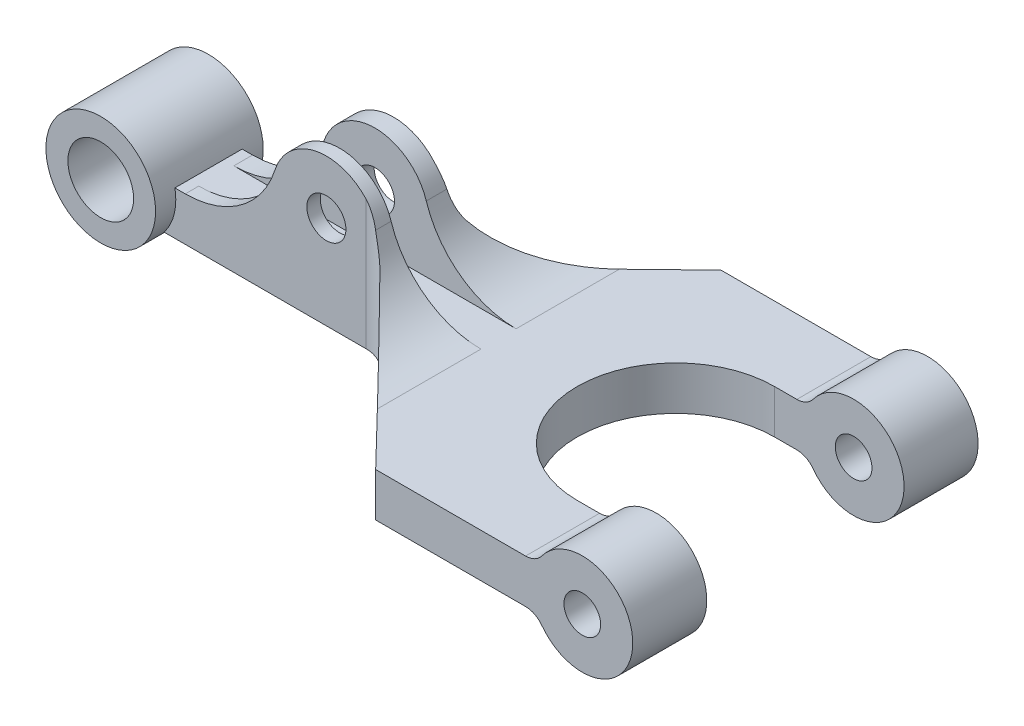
ISO-10303-21;
HEADER;
FILE_DESCRIPTION(('STEP AP214'),'2;1');
FILE_NAME('part.step','',(''),(''),'','','');
FILE_SCHEMA(('AUTOMOTIVE_DESIGN { 1 0 10303 214 1 1 1 1 }'));
ENDSEC;
DATA;
#1=APPLICATION_CONTEXT('core data for automotive mechanical design processes');
#2=APPLICATION_PROTOCOL_DEFINITION('international standard','automotive_design',2000,#1);
#3=PRODUCT_CONTEXT('',#1,'mechanical');
#4=PRODUCT('Part','Part','',(#3));
#5=PRODUCT_RELATED_PRODUCT_CATEGORY('part','',(#4));
#6=PRODUCT_DEFINITION_FORMATION('','',#4);
#7=PRODUCT_DEFINITION_CONTEXT('part definition',#1,'design');
#8=PRODUCT_DEFINITION('design','',#6,#7);
#9=PRODUCT_DEFINITION_SHAPE('','',#8);
#10=(LENGTH_UNIT() NAMED_UNIT(*) SI_UNIT(.MILLI.,.METRE.));
#11=(NAMED_UNIT(*) PLANE_ANGLE_UNIT() SI_UNIT($,.RADIAN.));
#12=(NAMED_UNIT(*) SI_UNIT($,.STERADIAN.) SOLID_ANGLE_UNIT());
#13=UNCERTAINTY_MEASURE_WITH_UNIT(LENGTH_MEASURE(1.E-05),#10,'distance_accuracy_value','');
#14=(GEOMETRIC_REPRESENTATION_CONTEXT(3) GLOBAL_UNCERTAINTY_ASSIGNED_CONTEXT((#13)) GLOBAL_UNIT_ASSIGNED_CONTEXT((#10,
#11,#12)) REPRESENTATION_CONTEXT('',''));
#15=CARTESIAN_POINT('',(0.,0.,0.));
#16=DIRECTION('',(0.,0.,1.));
#17=DIRECTION('',(1.,0.,0.));
#18=AXIS2_PLACEMENT_3D('',#15,#16,#17);
#19=CARTESIAN_POINT('',(12.7411288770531,-63.13435232,-10.));
#20=DIRECTION('',(0.,0.,1.));
#21=DIRECTION('',(1.,0.,0.));
#22=AXIS2_PLACEMENT_3D('',#19,#20,#21);
#23=CYLINDRICAL_SURFACE('',#22,8.);
#24=CARTESIAN_POINT('',(12.7411288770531,-63.13435232,-1.99189092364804));
#25=DIRECTION('',(0.,0.,-1.));
#26=DIRECTION('',(0.,1.,0.));
#27=AXIS2_PLACEMENT_3D('',#24,#25,#26);
#28=CIRCLE('',#27,8.);
#29=CARTESIAN_POINT('',(20.3687027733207,-60.7218605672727,-1.99189092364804));
#30=VERTEX_POINT('',#29);
#31=CARTESIAN_POINT('',(5.11355498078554,-60.7218605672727,-1.99189092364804));
#32=VERTEX_POINT('',#31);
#33=EDGE_CURVE('E243',#30,#32,#28,.F.);
#34=ORIENTED_EDGE('',*,*,#33,.T.);
#35=DIRECTION('',(0.,0.,1.));
#36=VECTOR('',#35,1.);
#37=CARTESIAN_POINT('',(5.11355498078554,-60.7218605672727,-10.));
#38=LINE('',#37,#36);
#39=CARTESIAN_POINT('',(5.11355498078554,-60.7218605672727,0.));
#40=VERTEX_POINT('',#39);
#41=EDGE_CURVE('E324',#32,#40,#38,.T.);
#42=ORIENTED_EDGE('',*,*,#41,.T.);
#43=CARTESIAN_POINT('',(12.7411288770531,-63.13435232,0.));
#44=DIRECTION('',(0.,0.,1.));
#45=DIRECTION('',(1.,0.,0.));
#46=AXIS2_PLACEMENT_3D('',#43,#44,#45);
#47=CIRCLE('',#46,8.);
#48=CARTESIAN_POINT('',(18.6229943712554,-57.7118382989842,0.));
#49=VERTEX_POINT('',#48);
#50=EDGE_CURVE('E305',#49,#40,#47,.T.);
#51=ORIENTED_EDGE('',*,*,#50,.F.);
#52=CARTESIAN_POINT('',(18.6229943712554,-57.7118382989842,0.));
#53=CARTESIAN_POINT('',(18.7685939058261,-57.8697280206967,2.91416028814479E-05));
#54=CARTESIAN_POINT('',(18.9076779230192,-58.0333950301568,0.00635625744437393));
#55=CARTESIAN_POINT('',(19.171906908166,-58.3708607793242,0.0284484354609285));
#56=CARTESIAN_POINT('',(19.2970617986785,-58.5446521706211,0.0442067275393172));
#57=CARTESIAN_POINT('',(19.5306743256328,-58.8980556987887,0.0816816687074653));
#58=CARTESIAN_POINT('',(19.6393857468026,-59.0775128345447,0.103289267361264));
#59=CARTESIAN_POINT('',(19.8422120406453,-59.4440324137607,0.149811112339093));
#60=CARTESIAN_POINT('',(19.9363301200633,-59.6310931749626,0.174724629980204));
#61=CARTESIAN_POINT('',(20.0893222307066,-59.9673745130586,0.219344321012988));
#62=CARTESIAN_POINT('',(20.1512914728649,-60.1152162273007,0.238906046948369));
#63=CARTESIAN_POINT('',(20.26665757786,-60.4154463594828,0.277494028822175));
#64=CARTESIAN_POINT('',(20.319993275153,-60.5678588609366,0.296515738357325));
#65=CARTESIAN_POINT('',(20.3687027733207,-60.7218605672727,0.314650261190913));
#66=B_SPLINE_CURVE_WITH_KNOTS('',3,(#52,#53,#54,#55,#56,#57,#58,#59,#60,#61,#62,#63,#64,#65),
.UNSPECIFIED.,.F.,.F.,(4,2,2,2,2,2,4),(0.,0.643821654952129,1.2871817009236,1.91928757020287,
2.55125434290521,3.0354583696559,3.52295539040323),.UNSPECIFIED.);
#67=CARTESIAN_POINT('',(20.3687027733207,-60.7218605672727,0.314650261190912));
#68=VERTEX_POINT('',#67);
#69=EDGE_CURVE('E395',#49,#68,#66,.T.);
#70=ORIENTED_EDGE('',*,*,#69,.T.);
#71=DIRECTION('',(0.,0.,1.));
#72=VECTOR('',#71,1.);
#73=CARTESIAN_POINT('',(20.3687027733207,-60.7218605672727,-10.));
#74=LINE('',#73,#72);
#75=EDGE_CURVE('E62',#68,#30,#74,.F.);
#76=ORIENTED_EDGE('',*,*,#75,.T.);
#77=EDGE_LOOP('',(#34,#42,#51,#70,#76));
#78=FACE_BOUND('',#77,.T.);
#79=ADVANCED_FACE('F34',(#78),#23,.T.);
#80=DIRECTION('',(0.,0.,1.));
#81=VECTOR('',#80,1.);
#82=CARTESIAN_POINT('',(20.3687027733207,-60.7218605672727,-10.));
#83=LINE('',#82,#81);
#84=CARTESIAN_POINT('',(20.3687027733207,-60.7218605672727,-7.21988533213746));
#85=VERTEX_POINT('',#84);
#86=CARTESIAN_POINT('',(20.3687027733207,-60.7218605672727,-10.2807551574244));
#87=VERTEX_POINT('',#86);
#88=EDGE_CURVE('E54',#85,#87,#83,.F.);
#89=ORIENTED_EDGE('',*,*,#88,.T.);
#90=CARTESIAN_POINT('',(20.3687027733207,-60.7218605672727,-10.2807551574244));
#91=CARTESIAN_POINT('',(20.3046319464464,-60.5192759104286,-10.2583697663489));
#92=CARTESIAN_POINT('',(20.2325312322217,-60.3193959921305,-10.234554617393));
#93=CARTESIAN_POINT('',(20.0726017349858,-59.925823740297,-10.1865890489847));
#94=CARTESIAN_POINT('',(19.9847565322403,-59.7321381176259,-10.1624383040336));
#95=CARTESIAN_POINT('',(19.7955420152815,-59.3556164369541,-10.1168021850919));
#96=CARTESIAN_POINT('',(19.694447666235,-59.1726471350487,-10.095276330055));
#97=CARTESIAN_POINT('',(19.4780588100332,-58.8149289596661,-10.0570681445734));
#98=CARTESIAN_POINT('',(19.3627758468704,-58.6401735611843,-10.0403819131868));
#99=CARTESIAN_POINT('',(19.1595090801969,-58.3569283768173,-10.0189676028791));
#100=CARTESIAN_POINT('',(19.075325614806,-58.2458596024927,-10.0121060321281));
#101=CARTESIAN_POINT('',(18.9006561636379,-58.0275030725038,-10.0026118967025));
#102=CARTESIAN_POINT('',(18.8101350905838,-57.9202422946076,-10.0000051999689));
#103=CARTESIAN_POINT('',(18.7168165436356,-57.8154091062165,-10.));
#104=B_SPLINE_CURVE_WITH_KNOTS('',3,(#90,#91,#92,#93,#94,#95,#96,#97,#98,#99,#100,#101,#102,
#103),.UNSPECIFIED.,.F.,.F.,(4,2,2,2,2,2,4),(0.,0.640779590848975,1.28223137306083,
1.91201914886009,2.54129786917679,2.95966838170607,3.38057307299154),.UNSPECIFIED.);
#105=CARTESIAN_POINT('',(18.7168165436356,-57.8154091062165,-10.));
#106=VERTEX_POINT('',#105);
#107=EDGE_CURVE('E11',#87,#106,#104,.T.);
#108=ORIENTED_EDGE('',*,*,#107,.T.);
#109=CARTESIAN_POINT('',(12.7411288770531,-63.13435232,-10.));
#110=DIRECTION('',(0.,0.,1.));
#111=DIRECTION('',(1.,0.,0.));
#112=AXIS2_PLACEMENT_3D('',#109,#110,#111);
#113=CIRCLE('',#112,8.);
#114=CARTESIAN_POINT('',(5.11355498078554,-60.7218605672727,-10.));
#115=VERTEX_POINT('',#114);
#116=EDGE_CURVE('E308',#106,#115,#113,.T.);
#117=ORIENTED_EDGE('',*,*,#116,.T.);
#118=DIRECTION('',(0.,0.,1.));
#119=VECTOR('',#118,1.);
#120=CARTESIAN_POINT('',(5.11355498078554,-60.7218605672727,-10.));
#121=LINE('',#120,#119);
#122=CARTESIAN_POINT('',(5.11355498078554,-60.7218605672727,-7.21988533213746));
#123=VERTEX_POINT('',#122);
#124=EDGE_CURVE('E328',#115,#123,#121,.T.);
#125=ORIENTED_EDGE('',*,*,#124,.T.);
#126=CARTESIAN_POINT('',(12.7411288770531,-63.13435232,-7.21988533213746));
#127=DIRECTION('',(0.,0.,1.));
#128=DIRECTION('',(0.,-1.,0.));
#129=AXIS2_PLACEMENT_3D('',#126,#127,#128);
#130=CIRCLE('',#129,8.);
#131=EDGE_CURVE('E482',#123,#85,#130,.F.);
#132=ORIENTED_EDGE('',*,*,#131,.T.);
#133=EDGE_LOOP('',(#89,#108,#117,#125,#132));
#134=FACE_BOUND('',#133,.T.);
#135=ADVANCED_FACE('F415',(#134),#23,.T.);
#136=CARTESIAN_POINT('',(12.7411288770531,-63.13435232,-10.));
#137=DIRECTION('',(0.,0.,1.));
#138=DIRECTION('',(1.,0.,0.));
#139=AXIS2_PLACEMENT_3D('',#136,#137,#138);
#140=CYLINDRICAL_SURFACE('',#139,2.9);
#141=CARTESIAN_POINT('',(12.7411288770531,-63.13435232,0.));
#142=DIRECTION('',(0.,0.,1.));
#143=DIRECTION('',(1.,0.,0.));
#144=AXIS2_PLACEMENT_3D('',#141,#142,#143);
#145=CIRCLE('',#144,2.9);
#146=CARTESIAN_POINT('',(15.6411288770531,-63.13435232,0.));
#147=VERTEX_POINT('',#146);
#148=EDGE_CURVE('E301',#147,#147,#145,.T.);
#149=ORIENTED_EDGE('',*,*,#148,.T.);
#150=EDGE_LOOP('',(#149));
#151=FACE_BOUND('',#150,.T.);
#152=CARTESIAN_POINT('',(12.7411288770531,-63.13435232,-1.99189092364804));
#153=DIRECTION('',(0.,0.,-1.));
#154=DIRECTION('',(0.,1.,0.));
#155=AXIS2_PLACEMENT_3D('',#152,#153,#154);
#156=CIRCLE('',#155,2.9);
#157=CARTESIAN_POINT('',(12.7411288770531,-60.23435232,-1.99189092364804));
#158=VERTEX_POINT('',#157);
#159=EDGE_CURVE('E248',#158,#158,#156,.F.);
#160=ORIENTED_EDGE('',*,*,#159,.F.);
#161=EDGE_LOOP('',(#160));
#162=FACE_BOUND('',#161,.T.);
#163=ADVANCED_FACE('F488',(#151,#162),#140,.F.);
#164=CARTESIAN_POINT('',(12.7411288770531,-63.13435232,-10.));
#165=DIRECTION('',(0.,0.,1.));
#166=DIRECTION('',(1.,0.,0.));
#167=AXIS2_PLACEMENT_3D('',#164,#165,#166);
#168=CIRCLE('',#167,2.9);
#169=CARTESIAN_POINT('',(15.6411288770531,-63.13435232,-10.));
#170=VERTEX_POINT('',#169);
#171=EDGE_CURVE('E302',#170,#170,#168,.T.);
#172=ORIENTED_EDGE('',*,*,#171,.F.);
#173=EDGE_LOOP('',(#172));
#174=FACE_BOUND('',#173,.T.);
#175=CARTESIAN_POINT('',(12.7411288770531,-63.13435232,-7.21988533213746));
#176=DIRECTION('',(0.,0.,1.));
#177=DIRECTION('',(0.,-1.,0.));
#178=AXIS2_PLACEMENT_3D('',#175,#176,#177);
#179=CIRCLE('',#178,2.9);
#180=CARTESIAN_POINT('',(12.7411288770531,-66.03435232,-7.21988533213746));
#181=VERTEX_POINT('',#180);
#182=EDGE_CURVE('E479',#181,#181,#179,.F.);
#183=ORIENTED_EDGE('',*,*,#182,.F.);
#184=EDGE_LOOP('',(#183));
#185=FACE_BOUND('',#184,.T.);
#186=ADVANCED_FACE('F490',(#174,#185),#140,.F.);
#187=CARTESIAN_POINT('',(12.7411288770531,-63.13435232,-10.));
#188=DIRECTION('',(0.,0.,1.));
#189=DIRECTION('',(1.,0.,0.));
#190=AXIS2_PLACEMENT_3D('',#187,#188,#189);
#191=PLANE('',#190);
#192=ORIENTED_EDGE('',*,*,#171,.T.);
#193=EDGE_LOOP('',(#192));
#194=FACE_BOUND('',#193,.T.);
#195=ORIENTED_EDGE('',*,*,#116,.F.);
#196=DIRECTION('',(0.,-1.,0.));
#197=VECTOR('',#196,1.);
#198=CARTESIAN_POINT('',(18.7168165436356,-77.,-10.));
#199=LINE('',#198,#197);
#200=CARTESIAN_POINT('',(18.7168165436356,-77.,-10.));
#201=VERTEX_POINT('',#200);
#202=EDGE_CURVE('E389',#106,#201,#199,.T.);
#203=ORIENTED_EDGE('',*,*,#202,.T.);
#204=DIRECTION('',(-1.,0.,0.));
#205=VECTOR('',#204,1.);
#206=CARTESIAN_POINT('',(12.7411288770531,-77.,-10.));
#207=LINE('',#206,#205);
#208=CARTESIAN_POINT('',(-11.3864028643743,-77.,-10.));
#209=VERTEX_POINT('',#208);
#210=EDGE_CURVE('E267',#201,#209,#207,.T.);
#211=ORIENTED_EDGE('',*,*,#210,.T.);
#212=CARTESIAN_POINT('',(-17.7935503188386,-71.9601711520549,-10.));
#213=DIRECTION('',(0.,0.,1.));
#214=DIRECTION('',(1.,0.,0.));
#215=AXIS2_PLACEMENT_3D('',#212,#213,#214);
#216=CIRCLE('',#215,8.15177363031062);
#217=CARTESIAN_POINT('',(-9.7736180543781,-70.5,-10.));
#218=VERTEX_POINT('',#217);
#219=EDGE_CURVE('E220',#209,#218,#216,.T.);
#220=ORIENTED_EDGE('',*,*,#219,.T.);
#221=DIRECTION('',(-1.,0.,0.));
#222=VECTOR('',#221,1.);
#223=CARTESIAN_POINT('',(12.7411288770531,-70.5,-10.));
#224=LINE('',#223,#222);
#225=CARTESIAN_POINT('',(-8.23469933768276,-70.5,-10.));
#226=VERTEX_POINT('',#225);
#227=EDGE_CURVE('E287',#226,#218,#224,.T.);
#228=ORIENTED_EDGE('',*,*,#227,.F.);
#229=CARTESIAN_POINT('',(-8.23469933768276,-56.5,-10.));
#230=DIRECTION('',(0.,0.,1.));
#231=DIRECTION('',(1.,0.,0.));
#232=AXIS2_PLACEMENT_3D('',#229,#230,#231);
#233=CIRCLE('',#232,14.);
#234=EDGE_CURVE('E334',#226,#115,#233,.T.);
#235=ORIENTED_EDGE('',*,*,#234,.T.);
#236=EDGE_LOOP('',(#195,#203,#211,#220,#228,#235));
#237=FACE_BOUND('',#236,.T.);
#238=ADVANCED_FACE('F497',(#194,#237),#191,.F.);
#239=CARTESIAN_POINT('',(12.7411288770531,-63.13435232,0.));
#240=DIRECTION('',(0.,0.,1.));
#241=DIRECTION('',(1.,0.,0.));
#242=AXIS2_PLACEMENT_3D('',#239,#240,#241);
#243=PLANE('',#242);
#244=DIRECTION('',(1.,0.,0.));
#245=VECTOR('',#244,1.);
#246=CARTESIAN_POINT('',(20.7411288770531,-77.,0.));
#247=LINE('',#246,#245);
#248=CARTESIAN_POINT('',(-11.3864028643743,-77.,0.));
#249=VERTEX_POINT('',#248);
#250=CARTESIAN_POINT('',(18.6229943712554,-77.,0.));
#251=VERTEX_POINT('',#250);
#252=EDGE_CURVE('E232',#249,#251,#247,.T.);
#253=ORIENTED_EDGE('',*,*,#252,.T.);
#254=DIRECTION('',(0.,-1.,0.));
#255=VECTOR('',#254,1.);
#256=CARTESIAN_POINT('',(18.6229943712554,-63.13435232,0.));
#257=LINE('',#256,#255);
#258=EDGE_CURVE('E387',#251,#49,#257,.F.);
#259=ORIENTED_EDGE('',*,*,#258,.T.);
#260=ORIENTED_EDGE('',*,*,#50,.T.);
#261=CARTESIAN_POINT('',(-8.23469933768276,-56.5,0.));
#262=DIRECTION('',(0.,0.,1.));
#263=DIRECTION('',(1.,0.,0.));
#264=AXIS2_PLACEMENT_3D('',#261,#262,#263);
#265=CIRCLE('',#264,14.);
#266=CARTESIAN_POINT('',(-8.23469933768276,-70.5,0.));
#267=VERTEX_POINT('',#266);
#268=EDGE_CURVE('E332',#40,#267,#265,.F.);
#269=ORIENTED_EDGE('',*,*,#268,.T.);
#270=DIRECTION('',(1.,0.,0.));
#271=VECTOR('',#270,1.);
#272=CARTESIAN_POINT('',(20.7411288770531,-70.5,0.));
#273=LINE('',#272,#271);
#274=CARTESIAN_POINT('',(-9.7736180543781,-70.5,0.));
#275=VERTEX_POINT('',#274);
#276=EDGE_CURVE('E235',#275,#267,#273,.T.);
#277=ORIENTED_EDGE('',*,*,#276,.F.);
#278=CARTESIAN_POINT('',(-17.7935503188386,-71.9601711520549,0.));
#279=DIRECTION('',(0.,0.,1.));
#280=DIRECTION('',(1.,0.,0.));
#281=AXIS2_PLACEMENT_3D('',#278,#279,#280);
#282=CIRCLE('',#281,8.15177363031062);
#283=EDGE_CURVE('E217',#249,#275,#282,.T.);
#284=ORIENTED_EDGE('',*,*,#283,.F.);
#285=EDGE_LOOP('',(#253,#259,#260,#269,#277,#284));
#286=FACE_BOUND('',#285,.T.);
#287=ORIENTED_EDGE('',*,*,#148,.F.);
#288=EDGE_LOOP('',(#287));
#289=FACE_BOUND('',#288,.T.);
#290=ADVANCED_FACE('F230',(#286,#289),#243,.T.);
#291=CARTESIAN_POINT('',(60.343112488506,-70.5,-4.33827992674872));
#292=DIRECTION('',(0.,1.,0.));
#293=DIRECTION('',(0.,0.,1.));
#294=AXIS2_PLACEMENT_3D('',#291,#292,#293);
#295=PLANE('',#294);
#296=DIRECTION('',(1.,0.,0.));
#297=VECTOR('',#296,1.);
#298=CARTESIAN_POINT('',(41.3922499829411,-70.5,21.3234401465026));
#299=LINE('',#298,#297);
#300=CARTESIAN_POINT('',(41.3922499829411,-70.5,21.3234401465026));
#301=VERTEX_POINT('',#300);
#302=CARTESIAN_POINT('',(63.6650968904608,-70.5,21.3234401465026));
#303=VERTEX_POINT('',#302);
#304=EDGE_CURVE('E272',#301,#303,#299,.T.);
#305=ORIENTED_EDGE('',*,*,#304,.T.);
#306=DIRECTION('',(0.,0.,-1.));
#307=VECTOR('',#306,1.);
#308=CARTESIAN_POINT('',(63.6650968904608,-70.5,10.3234401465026));
#309=LINE('',#308,#307);
#310=CARTESIAN_POINT('',(63.6650968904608,-70.5,10.3234401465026));
#311=VERTEX_POINT('',#310);
#312=EDGE_CURVE('E360',#303,#311,#309,.T.);
#313=ORIENTED_EDGE('',*,*,#312,.T.);
#314=DIRECTION('',(-1.,0.,0.));
#315=VECTOR('',#314,1.);
#316=CARTESIAN_POINT('',(60.343112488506,-70.5,10.3234401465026));
#317=LINE('',#316,#315);
#318=CARTESIAN_POINT('',(60.343112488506,-70.5,10.3234401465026));
#319=VERTEX_POINT('',#318);
#320=EDGE_CURVE('E275',#311,#319,#317,.T.);
#321=ORIENTED_EDGE('',*,*,#320,.T.);
#322=CARTESIAN_POINT('',(60.343112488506,-70.5,-4.33827992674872));
#323=DIRECTION('',(0.,-1.,0.));
#324=DIRECTION('',(0.,0.,1.));
#325=AXIS2_PLACEMENT_3D('',#322,#323,#324);
#326=CIRCLE('',#325,14.6617200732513);
#327=CARTESIAN_POINT('',(60.343112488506,-70.5,-19.));
#328=VERTEX_POINT('',#327);
#329=EDGE_CURVE('E277',#319,#328,#326,.T.);
#330=ORIENTED_EDGE('',*,*,#329,.T.);
#331=DIRECTION('',(1.,0.,0.));
#332=VECTOR('',#331,1.);
#333=CARTESIAN_POINT('',(65.343112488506,-70.5,-19.));
#334=LINE('',#333,#332);
#335=CARTESIAN_POINT('',(63.6650968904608,-70.5,-19.));
#336=VERTEX_POINT('',#335);
#337=EDGE_CURVE('E279',#328,#336,#334,.T.);
#338=ORIENTED_EDGE('',*,*,#337,.T.);
#339=DIRECTION('',(0.,0.,-1.));
#340=VECTOR('',#339,1.);
#341=CARTESIAN_POINT('',(63.6650968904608,-70.5,-4.33827992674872));
#342=LINE('',#341,#340);
#343=CARTESIAN_POINT('',(63.6650968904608,-70.5,-30.));
#344=VERTEX_POINT('',#343);
#345=EDGE_CURVE('E357',#336,#344,#342,.T.);
#346=ORIENTED_EDGE('',*,*,#345,.T.);
#347=DIRECTION('',(-1.,0.,0.));
#348=VECTOR('',#347,1.);
#349=CARTESIAN_POINT('',(41.3922499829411,-70.5,-30.));
#350=LINE('',#349,#348);
#351=CARTESIAN_POINT('',(41.3922499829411,-70.5,-30.));
#352=VERTEX_POINT('',#351);
#353=EDGE_CURVE('E282',#344,#352,#350,.T.);
#354=ORIENTED_EDGE('',*,*,#353,.T.);
#355=DIRECTION('',(-0.718340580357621,0.,0.695691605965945));
#356=VECTOR('',#355,1.);
#357=CARTESIAN_POINT('',(20.7411288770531,-70.5,-10.));
#358=LINE('',#357,#356);
#359=CARTESIAN_POINT('',(33.716957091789,-70.5,-22.5667058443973));
#360=VERTEX_POINT('',#359);
#361=EDGE_CURVE('E284',#352,#360,#358,.T.);
#362=ORIENTED_EDGE('',*,*,#361,.T.);
#363=DIRECTION('',(0.,0.,-1.));
#364=VECTOR('',#363,1.);
#365=CARTESIAN_POINT('',(33.716957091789,-70.5,-7.21988533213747));
#366=LINE('',#365,#364);
#367=CARTESIAN_POINT('',(33.716957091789,-70.5,-7.21988533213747));
#368=VERTEX_POINT('',#367);
#369=EDGE_CURVE('E314',#360,#368,#366,.F.);
#370=ORIENTED_EDGE('',*,*,#369,.T.);
#371=DIRECTION('',(-1.,0.,0.));
#372=VECTOR('',#371,1.);
#373=CARTESIAN_POINT('',(65.343112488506,-70.5,-7.21988533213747));
#374=LINE('',#373,#372);
#375=CARTESIAN_POINT('',(-8.23469933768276,-70.5,-7.21988533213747));
#376=VERTEX_POINT('',#375);
#377=EDGE_CURVE('E474',#368,#376,#374,.T.);
#378=ORIENTED_EDGE('',*,*,#377,.T.);
#379=DIRECTION('',(0.,0.,-1.));
#380=VECTOR('',#379,1.);
#381=CARTESIAN_POINT('',(-8.23469933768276,-70.5,-10.));
#382=LINE('',#381,#380);
#383=EDGE_CURVE('E317',#376,#226,#382,.T.);
#384=ORIENTED_EDGE('',*,*,#383,.T.);
#385=ORIENTED_EDGE('',*,*,#227,.T.);
#386=DIRECTION('',(0.,0.,1.));
#387=VECTOR('',#386,1.);
#388=CARTESIAN_POINT('',(-9.7736180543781,-70.5,-13.));
#389=LINE('',#388,#387);
#390=EDGE_CURVE('E459',#275,#218,#389,.F.);
#391=ORIENTED_EDGE('',*,*,#390,.F.);
#392=ORIENTED_EDGE('',*,*,#276,.T.);
#393=DIRECTION('',(0.,0.,-1.));
#394=VECTOR('',#393,1.);
#395=CARTESIAN_POINT('',(-8.23469933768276,-70.5,-1.99189092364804));
#396=LINE('',#395,#394);
#397=CARTESIAN_POINT('',(-8.23469933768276,-70.5,-1.99189092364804));
#398=VERTEX_POINT('',#397);
#399=EDGE_CURVE('E320',#267,#398,#396,.T.);
#400=ORIENTED_EDGE('',*,*,#399,.T.);
#401=DIRECTION('',(-1.,0.,0.));
#402=VECTOR('',#401,1.);
#403=CARTESIAN_POINT('',(65.343112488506,-70.5,-1.99189092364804));
#404=LINE('',#403,#402);
#405=CARTESIAN_POINT('',(33.716957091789,-70.5,-1.99189092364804));
#406=VERTEX_POINT('',#405);
#407=EDGE_CURVE('E458',#406,#398,#404,.T.);
#408=ORIENTED_EDGE('',*,*,#407,.F.);
#409=DIRECTION('',(0.,0.,-1.));
#410=VECTOR('',#409,1.);
#411=CARTESIAN_POINT('',(33.716957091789,-70.5,0.));
#412=LINE('',#411,#410);
#413=CARTESIAN_POINT('',(33.716957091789,-70.5,13.3982699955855));
#414=VERTEX_POINT('',#413);
#415=EDGE_CURVE('E310',#406,#414,#412,.F.);
#416=ORIENTED_EDGE('',*,*,#415,.T.);
#417=DIRECTION('',(0.695691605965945,0.,0.718340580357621));
#418=VECTOR('',#417,1.);
#419=CARTESIAN_POINT('',(20.7411288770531,-70.5,0.));
#420=LINE('',#419,#418);
#421=EDGE_CURVE('E270',#414,#301,#420,.T.);
#422=ORIENTED_EDGE('',*,*,#421,.T.);
#423=EDGE_LOOP('',(#305,#313,#321,#330,#338,#346,#354,#362,#370,#378,#384,#385,#391,#392,#400,
#408,#416,#422));
#424=FACE_BOUND('',#423,.T.);
#425=ADVANCED_FACE('F457',(#424),#295,.T.);
#426=CARTESIAN_POINT('',(20.7411288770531,-70.5,0.));
#427=DIRECTION('',(0.718340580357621,0.,-0.695691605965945));
#428=DIRECTION('',(-0.695691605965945,0.,-0.718340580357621));
#429=AXIS2_PLACEMENT_3D('',#426,#427,#428);
#430=PLANE('',#429);
#431=CARTESIAN_POINT('',(33.716957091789,-56.5,13.3982699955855));
#432=DIRECTION('',(0.718340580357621,0.,-0.695691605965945));
#433=DIRECTION('',(0.695691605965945,0.,0.718340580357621));
#434=AXIS2_PLACEMENT_3D('',#431,#432,#433);
#435=ELLIPSE('',#434,20.1238593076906,14.);
#436=CARTESIAN_POINT('',(22.2146972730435,-64.481103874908,1.52154197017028));
#437=VERTEX_POINT('',#436);
#438=EDGE_CURVE('E344',#414,#437,#435,.T.);
#439=ORIENTED_EDGE('',*,*,#438,.T.);
#440=DIRECTION('',(0.,-1.,0.));
#441=VECTOR('',#440,1.);
#442=CARTESIAN_POINT('',(22.2146972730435,-70.5,1.52154197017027));
#443=LINE('',#442,#441);
#444=CARTESIAN_POINT('',(22.2146972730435,-77.,1.52154197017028));
#445=VERTEX_POINT('',#444);
#446=EDGE_CURVE('E384',#437,#445,#443,.T.);
#447=ORIENTED_EDGE('',*,*,#446,.T.);
#448=DIRECTION('',(0.695691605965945,0.,0.718340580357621));
#449=VECTOR('',#448,1.);
#450=CARTESIAN_POINT('',(20.7411288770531,-77.,0.));
#451=LINE('',#450,#449);
#452=CARTESIAN_POINT('',(41.3922499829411,-77.,21.3234401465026));
#453=VERTEX_POINT('',#452);
#454=EDGE_CURVE('E242',#445,#453,#451,.T.);
#455=ORIENTED_EDGE('',*,*,#454,.T.);
#456=DIRECTION('',(0.,-1.,0.));
#457=VECTOR('',#456,1.);
#458=CARTESIAN_POINT('',(41.3922499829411,-70.5,21.3234401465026));
#459=LINE('',#458,#457);
#460=EDGE_CURVE('E298',#301,#453,#459,.T.);
#461=ORIENTED_EDGE('',*,*,#460,.F.);
#462=ORIENTED_EDGE('',*,*,#421,.F.);
#463=EDGE_LOOP('',(#439,#447,#455,#461,#462));
#464=FACE_BOUND('',#463,.T.);
#465=ADVANCED_FACE('F448',(#464),#430,.F.);
#466=CARTESIAN_POINT('',(41.3922499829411,-70.5,21.3234401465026));
#467=DIRECTION('',(0.,0.,-1.));
#468=DIRECTION('',(-1.,0.,0.));
#469=AXIS2_PLACEMENT_3D('',#466,#467,#468);
#470=PLANE('',#469);
#471=DIRECTION('',(1.,0.,0.));
#472=VECTOR('',#471,1.);
#473=CARTESIAN_POINT('',(41.3922499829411,-77.,21.3234401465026));
#474=LINE('',#473,#472);
#475=CARTESIAN_POINT('',(63.6650968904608,-77.,21.3234401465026));
#476=VERTEX_POINT('',#475);
#477=EDGE_CURVE('E245',#453,#476,#474,.T.);
#478=ORIENTED_EDGE('',*,*,#477,.T.);
#479=CARTESIAN_POINT('',(63.6650968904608,-80.,21.3234401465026));
#480=DIRECTION('',(0.,0.,-1.));
#481=DIRECTION('',(-1.,0.,0.));
#482=AXIS2_PLACEMENT_3D('',#479,#480,#481);
#483=CIRCLE('',#482,3.);
#484=CARTESIAN_POINT('',(66.0757450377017,-78.2142857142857,21.3234401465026));
#485=VERTEX_POINT('',#484);
#486=EDGE_CURVE('E370',#476,#485,#483,.T.);
#487=ORIENTED_EDGE('',*,*,#486,.T.);
#488=CARTESIAN_POINT('',(72.1023654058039,-73.75,21.3234401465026));
#489=DIRECTION('',(0.,0.,1.));
#490=DIRECTION('',(1.,0.,0.));
#491=AXIS2_PLACEMENT_3D('',#488,#489,#490);
#492=CIRCLE('',#491,7.50000000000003);
#493=CARTESIAN_POINT('',(66.0757450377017,-69.2857142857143,21.3234401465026));
#494=VERTEX_POINT('',#493);
#495=EDGE_CURVE('E469',#485,#494,#492,.T.);
#496=ORIENTED_EDGE('',*,*,#495,.T.);
#497=CARTESIAN_POINT('',(63.6650968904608,-67.5,21.3234401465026));
#498=DIRECTION('',(0.,0.,-1.));
#499=DIRECTION('',(-1.,0.,0.));
#500=AXIS2_PLACEMENT_3D('',#497,#498,#499);
#501=CIRCLE('',#500,3.);
#502=EDGE_CURVE('E374',#494,#303,#501,.T.);
#503=ORIENTED_EDGE('',*,*,#502,.T.);
#504=ORIENTED_EDGE('',*,*,#304,.F.);
#505=ORIENTED_EDGE('',*,*,#460,.T.);
#506=EDGE_LOOP('',(#478,#487,#496,#503,#504,#505));
#507=FACE_BOUND('',#506,.T.);
#508=CARTESIAN_POINT('',(72.1023654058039,-73.75,21.3234401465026));
#509=DIRECTION('',(0.,0.,1.));
#510=DIRECTION('',(1.,0.,0.));
#511=AXIS2_PLACEMENT_3D('',#508,#509,#510);
#512=CIRCLE('',#511,2.72660472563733);
#513=CARTESIAN_POINT('',(74.8289701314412,-73.75,21.3234401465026));
#514=VERTEX_POINT('',#513);
#515=EDGE_CURVE('E461',#514,#514,#512,.T.);
#516=ORIENTED_EDGE('',*,*,#515,.F.);
#517=EDGE_LOOP('',(#516));
#518=FACE_BOUND('',#517,.T.);
#519=ADVANCED_FACE('F610',(#507,#518),#470,.F.);
#520=CARTESIAN_POINT('',(60.343112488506,-70.5,10.3234401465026));
#521=DIRECTION('',(0.,0.,1.));
#522=DIRECTION('',(1.,0.,0.));
#523=AXIS2_PLACEMENT_3D('',#520,#521,#522);
#524=PLANE('',#523);
#525=ORIENTED_EDGE('',*,*,#320,.F.);
#526=CARTESIAN_POINT('',(63.6650968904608,-67.5,10.3234401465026));
#527=DIRECTION('',(0.,0.,1.));
#528=DIRECTION('',(1.,0.,0.));
#529=AXIS2_PLACEMENT_3D('',#526,#527,#528);
#530=CIRCLE('',#529,3.);
#531=CARTESIAN_POINT('',(66.0757450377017,-69.2857142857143,10.3234401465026));
#532=VERTEX_POINT('',#531);
#533=EDGE_CURVE('E372',#311,#532,#530,.T.);
#534=ORIENTED_EDGE('',*,*,#533,.T.);
#535=CARTESIAN_POINT('',(72.1023654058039,-73.75,10.3234401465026));
#536=DIRECTION('',(0.,0.,1.));
#537=DIRECTION('',(1.,0.,0.));
#538=AXIS2_PLACEMENT_3D('',#535,#536,#537);
#539=CIRCLE('',#538,7.50000000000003);
#540=CARTESIAN_POINT('',(66.0757450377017,-78.2142857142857,10.3234401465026));
#541=VERTEX_POINT('',#540);
#542=EDGE_CURVE('E471',#541,#532,#539,.T.);
#543=ORIENTED_EDGE('',*,*,#542,.F.);
#544=CARTESIAN_POINT('',(63.6650968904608,-80.,10.3234401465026));
#545=DIRECTION('',(0.,0.,1.));
#546=DIRECTION('',(1.,0.,0.));
#547=AXIS2_PLACEMENT_3D('',#544,#545,#546);
#548=CIRCLE('',#547,3.);
#549=CARTESIAN_POINT('',(63.6650968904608,-77.,10.3234401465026));
#550=VERTEX_POINT('',#549);
#551=EDGE_CURVE('E368',#541,#550,#548,.T.);
#552=ORIENTED_EDGE('',*,*,#551,.T.);
#553=DIRECTION('',(-1.,0.,0.));
#554=VECTOR('',#553,1.);
#555=CARTESIAN_POINT('',(60.343112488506,-77.,10.3234401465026));
#556=LINE('',#555,#554);
#557=CARTESIAN_POINT('',(60.343112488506,-77.,10.3234401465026));
#558=VERTEX_POINT('',#557);
#559=EDGE_CURVE('E254',#550,#558,#556,.T.);
#560=ORIENTED_EDGE('',*,*,#559,.T.);
#561=DIRECTION('',(0.,-1.,0.));
#562=VECTOR('',#561,1.);
#563=CARTESIAN_POINT('',(60.343112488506,-70.5,10.3234401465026));
#564=LINE('',#563,#562);
#565=EDGE_CURVE('E295',#319,#558,#564,.T.);
#566=ORIENTED_EDGE('',*,*,#565,.F.);
#567=EDGE_LOOP('',(#525,#534,#543,#552,#560,#566));
#568=FACE_BOUND('',#567,.T.);
#569=CARTESIAN_POINT('',(72.1023654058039,-73.75,10.3234401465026));
#570=DIRECTION('',(0.,0.,1.));
#571=DIRECTION('',(1.,0.,0.));
#572=AXIS2_PLACEMENT_3D('',#569,#570,#571);
#573=CIRCLE('',#572,2.72660472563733);
#574=CARTESIAN_POINT('',(74.8289701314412,-73.75,10.3234401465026));
#575=VERTEX_POINT('',#574);
#576=EDGE_CURVE('E464',#575,#575,#573,.T.);
#577=ORIENTED_EDGE('',*,*,#576,.T.);
#578=EDGE_LOOP('',(#577));
#579=FACE_BOUND('',#578,.T.);
#580=ADVANCED_FACE('F607',(#568,#579),#524,.F.);
#581=CARTESIAN_POINT('',(60.343112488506,-70.5,-4.33827992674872));
#582=DIRECTION('',(0.,-1.,0.));
#583=DIRECTION('',(0.,0.,-1.));
#584=AXIS2_PLACEMENT_3D('',#581,#582,#583);
#585=CYLINDRICAL_SURFACE('',#584,14.6617200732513);
#586=ORIENTED_EDGE('',*,*,#565,.T.);
#587=CARTESIAN_POINT('',(60.343112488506,-77.,-4.33827992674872));
#588=DIRECTION('',(0.,-1.,0.));
#589=DIRECTION('',(0.,0.,1.));
#590=AXIS2_PLACEMENT_3D('',#587,#588,#589);
#591=CIRCLE('',#590,14.6617200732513);
#592=CARTESIAN_POINT('',(60.343112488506,-77.,-19.));
#593=VERTEX_POINT('',#592);
#594=EDGE_CURVE('E256',#558,#593,#591,.T.);
#595=ORIENTED_EDGE('',*,*,#594,.T.);
#596=DIRECTION('',(0.,-1.,0.));
#597=VECTOR('',#596,1.);
#598=CARTESIAN_POINT('',(60.343112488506,-70.5,-19.));
#599=LINE('',#598,#597);
#600=EDGE_CURVE('E293',#328,#593,#599,.T.);
#601=ORIENTED_EDGE('',*,*,#600,.F.);
#602=ORIENTED_EDGE('',*,*,#329,.F.);
#603=EDGE_LOOP('',(#586,#595,#601,#602));
#604=FACE_BOUND('',#603,.T.);
#605=ADVANCED_FACE('F604',(#604),#585,.F.);
#606=CARTESIAN_POINT('',(65.343112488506,-70.5,-19.));
#607=DIRECTION('',(0.,0.,-1.));
#608=DIRECTION('',(-1.,0.,0.));
#609=AXIS2_PLACEMENT_3D('',#606,#607,#608);
#610=PLANE('',#609);
#611=DIRECTION('',(1.,0.,0.));
#612=VECTOR('',#611,1.);
#613=CARTESIAN_POINT('',(65.343112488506,-77.,-19.));
#614=LINE('',#613,#612);
#615=CARTESIAN_POINT('',(63.6650968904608,-77.,-19.));
#616=VERTEX_POINT('',#615);
#617=EDGE_CURVE('E259',#593,#616,#614,.T.);
#618=ORIENTED_EDGE('',*,*,#617,.T.);
#619=CARTESIAN_POINT('',(63.6650968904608,-80.,-19.));
#620=DIRECTION('',(0.,0.,-1.));
#621=DIRECTION('',(-1.,0.,0.));
#622=AXIS2_PLACEMENT_3D('',#619,#620,#621);
#623=CIRCLE('',#622,3.);
#624=CARTESIAN_POINT('',(66.0757450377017,-78.2142857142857,-19.));
#625=VERTEX_POINT('',#624);
#626=EDGE_CURVE('E378',#616,#625,#623,.T.);
#627=ORIENTED_EDGE('',*,*,#626,.T.);
#628=CARTESIAN_POINT('',(72.1023654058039,-73.75,-19.));
#629=DIRECTION('',(0.,0.,1.));
#630=DIRECTION('',(1.,0.,0.));
#631=AXIS2_PLACEMENT_3D('',#628,#629,#630);
#632=CIRCLE('',#631,7.5);
#633=CARTESIAN_POINT('',(66.0757450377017,-69.2857142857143,-19.));
#634=VERTEX_POINT('',#633);
#635=EDGE_CURVE('E536',#625,#634,#632,.T.);
#636=ORIENTED_EDGE('',*,*,#635,.T.);
#637=CARTESIAN_POINT('',(63.6650968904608,-67.5,-19.));
#638=DIRECTION('',(0.,0.,-1.));
#639=DIRECTION('',(-1.,0.,0.));
#640=AXIS2_PLACEMENT_3D('',#637,#638,#639);
#641=CIRCLE('',#640,3.);
#642=EDGE_CURVE('E382',#634,#336,#641,.T.);
#643=ORIENTED_EDGE('',*,*,#642,.T.);
#644=ORIENTED_EDGE('',*,*,#337,.F.);
#645=ORIENTED_EDGE('',*,*,#600,.T.);
#646=EDGE_LOOP('',(#618,#627,#636,#643,#644,#645));
#647=FACE_BOUND('',#646,.T.);
#648=CARTESIAN_POINT('',(72.1023654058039,-73.75,-19.));
#649=DIRECTION('',(0.,0.,1.));
#650=DIRECTION('',(1.,0.,0.));
#651=AXIS2_PLACEMENT_3D('',#648,#649,#650);
#652=CIRCLE('',#651,2.72500000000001);
#653=CARTESIAN_POINT('',(74.8273654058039,-73.75,-19.));
#654=VERTEX_POINT('',#653);
#655=EDGE_CURVE('E549',#654,#654,#652,.T.);
#656=ORIENTED_EDGE('',*,*,#655,.F.);
#657=EDGE_LOOP('',(#656));
#658=FACE_BOUND('',#657,.T.);
#659=ADVANCED_FACE('F534',(#647,#658),#610,.F.);
#660=CARTESIAN_POINT('',(41.3922499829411,-70.5,-30.));
#661=DIRECTION('',(0.,0.,1.));
#662=DIRECTION('',(1.,0.,0.));
#663=AXIS2_PLACEMENT_3D('',#660,#661,#662);
#664=PLANE('',#663);
#665=ORIENTED_EDGE('',*,*,#353,.F.);
#666=CARTESIAN_POINT('',(63.6650968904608,-67.5,-30.));
#667=DIRECTION('',(0.,0.,1.));
#668=DIRECTION('',(1.,0.,0.));
#669=AXIS2_PLACEMENT_3D('',#666,#667,#668);
#670=CIRCLE('',#669,3.);
#671=CARTESIAN_POINT('',(66.0757450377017,-69.2857142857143,-30.));
#672=VERTEX_POINT('',#671);
#673=EDGE_CURVE('E380',#344,#672,#670,.T.);
#674=ORIENTED_EDGE('',*,*,#673,.T.);
#675=CARTESIAN_POINT('',(72.1023654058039,-73.75,-30.));
#676=DIRECTION('',(0.,0.,1.));
#677=DIRECTION('',(1.,0.,0.));
#678=AXIS2_PLACEMENT_3D('',#675,#676,#677);
#679=CIRCLE('',#678,7.5);
#680=CARTESIAN_POINT('',(66.0757450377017,-78.2142857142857,-30.));
#681=VERTEX_POINT('',#680);
#682=EDGE_CURVE('E544',#681,#672,#679,.T.);
#683=ORIENTED_EDGE('',*,*,#682,.F.);
#684=CARTESIAN_POINT('',(63.6650968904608,-80.,-30.));
#685=DIRECTION('',(0.,0.,1.));
#686=DIRECTION('',(1.,0.,0.));
#687=AXIS2_PLACEMENT_3D('',#684,#685,#686);
#688=CIRCLE('',#687,3.);
#689=CARTESIAN_POINT('',(63.6650968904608,-77.,-30.));
#690=VERTEX_POINT('',#689);
#691=EDGE_CURVE('E376',#681,#690,#688,.T.);
#692=ORIENTED_EDGE('',*,*,#691,.T.);
#693=DIRECTION('',(-1.,0.,0.));
#694=VECTOR('',#693,1.);
#695=CARTESIAN_POINT('',(41.3922499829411,-77.,-30.));
#696=LINE('',#695,#694);
#697=CARTESIAN_POINT('',(41.3922499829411,-77.,-30.));
#698=VERTEX_POINT('',#697);
#699=EDGE_CURVE('E262',#690,#698,#696,.T.);
#700=ORIENTED_EDGE('',*,*,#699,.T.);
#701=DIRECTION('',(0.,-1.,0.));
#702=VECTOR('',#701,1.);
#703=CARTESIAN_POINT('',(41.3922499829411,-70.5,-30.));
#704=LINE('',#703,#702);
#705=EDGE_CURVE('E290',#352,#698,#704,.T.);
#706=ORIENTED_EDGE('',*,*,#705,.F.);
#707=EDGE_LOOP('',(#665,#674,#683,#692,#700,#706));
#708=FACE_BOUND('',#707,.T.);
#709=CARTESIAN_POINT('',(72.1023654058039,-73.75,-30.));
#710=DIRECTION('',(0.,0.,1.));
#711=DIRECTION('',(1.,0.,0.));
#712=AXIS2_PLACEMENT_3D('',#709,#710,#711);
#713=CIRCLE('',#712,2.72500000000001);
#714=CARTESIAN_POINT('',(74.8273654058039,-73.75,-30.));
#715=VERTEX_POINT('',#714);
#716=EDGE_CURVE('E552',#715,#715,#713,.T.);
#717=ORIENTED_EDGE('',*,*,#716,.T.);
#718=EDGE_LOOP('',(#717));
#719=FACE_BOUND('',#718,.T.);
#720=ADVANCED_FACE('F599',(#708,#719),#664,.F.);
#721=CARTESIAN_POINT('',(20.7411288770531,-70.5,-10.));
#722=DIRECTION('',(0.695691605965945,0.,0.718340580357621));
#723=DIRECTION('',(0.718340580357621,0.,-0.695691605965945));
#724=AXIS2_PLACEMENT_3D('',#721,#722,#723);
#725=PLANE('',#724);
#726=DIRECTION('',(-0.718340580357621,0.,0.695691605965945));
#727=VECTOR('',#726,1.);
#728=CARTESIAN_POINT('',(20.7411288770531,-77.,-10.));
#729=LINE('',#728,#727);
#730=CARTESIAN_POINT('',(22.1952745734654,-77.,-11.4082970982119));
#731=VERTEX_POINT('',#730);
#732=EDGE_CURVE('E264',#698,#731,#729,.T.);
#733=ORIENTED_EDGE('',*,*,#732,.T.);
#734=DIRECTION('',(0.,-1.,0.));
#735=VECTOR('',#734,1.);
#736=CARTESIAN_POINT('',(22.1952745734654,-61.7562231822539,-11.4082970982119));
#737=LINE('',#736,#735);
#738=CARTESIAN_POINT('',(22.1952745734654,-64.4530391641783,-11.4082970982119));
#739=VERTEX_POINT('',#738);
#740=EDGE_CURVE('E392',#731,#739,#737,.F.);
#741=ORIENTED_EDGE('',*,*,#740,.T.);
#742=CARTESIAN_POINT('',(33.716957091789,-56.5,-22.5667058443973));
#743=DIRECTION('',(0.695691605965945,0.,0.718340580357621));
#744=DIRECTION('',(-0.718340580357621,0.,0.695691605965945));
#745=AXIS2_PLACEMENT_3D('',#742,#743,#744);
#746=ELLIPSE('',#745,19.4893625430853,14.);
#747=EDGE_CURVE('E342',#739,#360,#746,.T.);
#748=ORIENTED_EDGE('',*,*,#747,.T.);
#749=ORIENTED_EDGE('',*,*,#361,.F.);
#750=ORIENTED_EDGE('',*,*,#705,.T.);
#751=EDGE_LOOP('',(#733,#741,#748,#749,#750));
#752=FACE_BOUND('',#751,.T.);
#753=ADVANCED_FACE('F517',(#752),#725,.F.);
#754=CARTESIAN_POINT('',(60.343112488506,-77.,-4.33827992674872));
#755=DIRECTION('',(0.,1.,0.));
#756=DIRECTION('',(0.,0.,1.));
#757=AXIS2_PLACEMENT_3D('',#754,#755,#756);
#758=PLANE('',#757);
#759=ORIENTED_EDGE('',*,*,#559,.F.);
#760=DIRECTION('',(0.,0.,1.));
#761=VECTOR('',#760,1.);
#762=CARTESIAN_POINT('',(63.6650968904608,-77.,-4.33827992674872));
#763=LINE('',#762,#761);
#764=EDGE_CURVE('E355',#550,#476,#763,.T.);
#765=ORIENTED_EDGE('',*,*,#764,.T.);
#766=ORIENTED_EDGE('',*,*,#477,.F.);
#767=ORIENTED_EDGE('',*,*,#454,.F.);
#768=CARTESIAN_POINT('',(18.6229943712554,-77.,5.));
#769=DIRECTION('',(0.,1.,0.));
#770=DIRECTION('',(0.,0.,1.));
#771=AXIS2_PLACEMENT_3D('',#768,#769,#770);
#772=CIRCLE('',#771,5.);
#773=EDGE_CURVE('E241',#445,#251,#772,.T.);
#774=ORIENTED_EDGE('',*,*,#773,.T.);
#775=ORIENTED_EDGE('',*,*,#252,.F.);
#776=DIRECTION('',(0.,0.,1.));
#777=VECTOR('',#776,1.);
#778=CARTESIAN_POINT('',(-11.3864028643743,-77.,-13.));
#779=LINE('',#778,#777);
#780=EDGE_CURVE('E213',#249,#209,#779,.F.);
#781=ORIENTED_EDGE('',*,*,#780,.T.);
#782=ORIENTED_EDGE('',*,*,#210,.F.);
#783=CARTESIAN_POINT('',(18.7168165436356,-77.,-15.));
#784=DIRECTION('',(0.,1.,0.));
#785=DIRECTION('',(0.,0.,1.));
#786=AXIS2_PLACEMENT_3D('',#783,#784,#785);
#787=CIRCLE('',#786,5.);
#788=EDGE_CURVE('E439',#201,#731,#787,.T.);
#789=ORIENTED_EDGE('',*,*,#788,.T.);
#790=ORIENTED_EDGE('',*,*,#732,.F.);
#791=ORIENTED_EDGE('',*,*,#699,.F.);
#792=DIRECTION('',(0.,0.,1.));
#793=VECTOR('',#792,1.);
#794=CARTESIAN_POINT('',(63.6650968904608,-77.,-19.));
#795=LINE('',#794,#793);
#796=EDGE_CURVE('E353',#690,#616,#795,.T.);
#797=ORIENTED_EDGE('',*,*,#796,.T.);
#798=ORIENTED_EDGE('',*,*,#617,.F.);
#799=ORIENTED_EDGE('',*,*,#594,.F.);
#800=EDGE_LOOP('',(#759,#765,#766,#767,#774,#775,#781,#782,#789,#790,#791,#797,#798,#799));
#801=FACE_BOUND('',#800,.T.);
#802=ADVANCED_FACE('F239',(#801),#758,.F.);
#803=CARTESIAN_POINT('',(65.343112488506,-52.3482254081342,-1.99189092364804));
#804=DIRECTION('',(0.,0.,-1.));
#805=DIRECTION('',(0.,1.,0.));
#806=AXIS2_PLACEMENT_3D('',#803,#804,#805);
#807=PLANE('',#806);
#808=ORIENTED_EDGE('',*,*,#407,.T.);
#809=CARTESIAN_POINT('',(-8.23469933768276,-56.5,-1.99189092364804));
#810=DIRECTION('',(0.,0.,-1.));
#811=DIRECTION('',(0.,1.,0.));
#812=AXIS2_PLACEMENT_3D('',#809,#810,#811);
#813=CIRCLE('',#812,14.);
#814=EDGE_CURVE('E330',#398,#32,#813,.F.);
#815=ORIENTED_EDGE('',*,*,#814,.T.);
#816=ORIENTED_EDGE('',*,*,#33,.F.);
#817=CARTESIAN_POINT('',(33.716957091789,-56.5,-1.99189092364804));
#818=DIRECTION('',(0.,0.,-1.));
#819=DIRECTION('',(0.,1.,0.));
#820=AXIS2_PLACEMENT_3D('',#817,#818,#819);
#821=CIRCLE('',#820,14.);
#822=EDGE_CURVE('E225',#30,#406,#821,.F.);
#823=ORIENTED_EDGE('',*,*,#822,.T.);
#824=EDGE_LOOP('',(#808,#815,#816,#823));
#825=FACE_BOUND('',#824,.T.);
#826=ORIENTED_EDGE('',*,*,#159,.T.);
#827=EDGE_LOOP('',(#826));
#828=FACE_BOUND('',#827,.T.);
#829=ADVANCED_FACE('F486',(#825,#828),#807,.T.);
#830=CARTESIAN_POINT('',(65.343112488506,-52.3482254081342,-7.21988533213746));
#831=DIRECTION('',(0.,0.,1.));
#832=DIRECTION('',(0.,-1.,0.));
#833=AXIS2_PLACEMENT_3D('',#830,#831,#832);
#834=PLANE('',#833);
#835=ORIENTED_EDGE('',*,*,#377,.F.);
#836=CARTESIAN_POINT('',(33.716957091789,-56.5,-7.21988533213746));
#837=DIRECTION('',(0.,0.,1.));
#838=DIRECTION('',(0.,-1.,0.));
#839=AXIS2_PLACEMENT_3D('',#836,#837,#838);
#840=CIRCLE('',#839,14.);
#841=EDGE_CURVE('E340',#368,#85,#840,.F.);
#842=ORIENTED_EDGE('',*,*,#841,.T.);
#843=ORIENTED_EDGE('',*,*,#131,.F.);
#844=CARTESIAN_POINT('',(-8.23469933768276,-56.5,-7.21988533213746));
#845=DIRECTION('',(0.,0.,1.));
#846=DIRECTION('',(0.,-1.,0.));
#847=AXIS2_PLACEMENT_3D('',#844,#845,#846);
#848=CIRCLE('',#847,14.);
#849=EDGE_CURVE('E337',#123,#376,#848,.F.);
#850=ORIENTED_EDGE('',*,*,#849,.T.);
#851=EDGE_LOOP('',(#835,#842,#843,#850));
#852=FACE_BOUND('',#851,.T.);
#853=ORIENTED_EDGE('',*,*,#182,.T.);
#854=EDGE_LOOP('',(#853));
#855=FACE_BOUND('',#854,.T.);
#856=ADVANCED_FACE('F423',(#852,#855),#834,.T.);
#857=CARTESIAN_POINT('',(-8.23469933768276,-56.5,-10.));
#858=DIRECTION('',(0.,0.,1.));
#859=DIRECTION('',(1.,0.,0.));
#860=AXIS2_PLACEMENT_3D('',#857,#858,#859);
#861=CYLINDRICAL_SURFACE('',#860,14.);
#862=ORIENTED_EDGE('',*,*,#268,.F.);
#863=ORIENTED_EDGE('',*,*,#41,.F.);
#864=ORIENTED_EDGE('',*,*,#814,.F.);
#865=ORIENTED_EDGE('',*,*,#399,.F.);
#866=EDGE_LOOP('',(#862,#863,#864,#865));
#867=FACE_BOUND('',#866,.T.);
#868=ADVANCED_FACE('F418',(#867),#861,.F.);
#869=CARTESIAN_POINT('',(-8.23469933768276,-56.5,-10.));
#870=DIRECTION('',(0.,0.,1.));
#871=DIRECTION('',(1.,0.,0.));
#872=AXIS2_PLACEMENT_3D('',#869,#870,#871);
#873=CYLINDRICAL_SURFACE('',#872,14.);
#874=ORIENTED_EDGE('',*,*,#849,.F.);
#875=ORIENTED_EDGE('',*,*,#124,.F.);
#876=ORIENTED_EDGE('',*,*,#234,.F.);
#877=ORIENTED_EDGE('',*,*,#383,.F.);
#878=EDGE_LOOP('',(#874,#875,#876,#877));
#879=FACE_BOUND('',#878,.T.);
#880=ADVANCED_FACE('F422',(#879),#873,.F.);
#881=CARTESIAN_POINT('',(33.716957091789,-56.5,-10.));
#882=DIRECTION('',(0.,0.,1.));
#883=DIRECTION('',(1.,0.,0.));
#884=AXIS2_PLACEMENT_3D('',#881,#882,#883);
#885=CYLINDRICAL_SURFACE('',#884,14.);
#886=ORIENTED_EDGE('',*,*,#747,.F.);
#887=CARTESIAN_POINT('',(22.1952745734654,-64.4530391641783,-11.4082970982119));
#888=CARTESIAN_POINT('',(22.1418137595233,-64.3755956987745,-11.3565269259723));
#889=CARTESIAN_POINT('',(22.088420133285,-64.2965665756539,-11.3071238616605));
#890=CARTESIAN_POINT('',(21.9821102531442,-64.1356172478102,-11.2127963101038));
#891=CARTESIAN_POINT('',(21.9291938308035,-64.0536981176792,-11.1678701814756));
#892=CARTESIAN_POINT('',(21.7718413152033,-63.8042965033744,-11.0395538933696));
#893=CARTESIAN_POINT('',(21.6685693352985,-63.6328346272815,-10.9624056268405));
#894=CARTESIAN_POINT('',(21.4688575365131,-63.2840871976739,-10.8237803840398));
#895=CARTESIAN_POINT('',(21.3723346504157,-63.1069393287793,-10.7620717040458));
#896=CARTESIAN_POINT('',(21.1856359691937,-62.7455869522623,-10.6506606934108));
#897=CARTESIAN_POINT('',(21.095462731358,-62.5613796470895,-10.600963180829));
#898=CARTESIAN_POINT('',(20.9479595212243,-62.2422884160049,-10.5248792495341));
#899=CARTESIAN_POINT('',(20.8887767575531,-62.1088516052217,-10.4959376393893));
#900=CARTESIAN_POINT('',(20.7743339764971,-61.8394674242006,-10.4425217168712));
#901=CARTESIAN_POINT('',(20.719072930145,-61.7035207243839,-10.4180462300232));
#902=CARTESIAN_POINT('',(20.6120364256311,-61.4277962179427,-10.3727366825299));
#903=CARTESIAN_POINT('',(20.5603092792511,-61.2879922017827,-10.351948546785));
#904=CARTESIAN_POINT('',(20.4612048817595,-61.0063676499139,-10.313861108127));
#905=CARTESIAN_POINT('',(20.4138279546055,-60.864546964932,-10.2965620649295));
#906=CARTESIAN_POINT('',(20.3687027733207,-60.7218605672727,-10.2807551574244));
#907=B_SPLINE_CURVE_WITH_KNOTS('',3,(#887,#888,#889,#890,#891,#892,#893,#894,#895,#896,#897,
#898,#899,#900,#901,#902,#903,#904,#905,#906),.UNSPECIFIED.,.F.,.F.,(4,2,2,2,2,2,2,2,2,4),(0.,
0.322123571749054,0.644128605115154,1.28675363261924,1.91906194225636,2.55162347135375,
2.99793300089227,3.44412499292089,3.89553422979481,4.3469770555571),.UNSPECIFIED.);
#908=EDGE_CURVE('E48',#739,#87,#907,.T.);
#909=ORIENTED_EDGE('',*,*,#908,.T.);
#910=ORIENTED_EDGE('',*,*,#88,.F.);
#911=ORIENTED_EDGE('',*,*,#841,.F.);
#912=ORIENTED_EDGE('',*,*,#369,.F.);
#913=EDGE_LOOP('',(#886,#909,#910,#911,#912));
#914=FACE_BOUND('',#913,.T.);
#915=ADVANCED_FACE('F427',(#914),#885,.F.);
#916=CARTESIAN_POINT('',(33.716957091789,-56.5,-10.));
#917=DIRECTION('',(0.,0.,1.));
#918=DIRECTION('',(1.,0.,0.));
#919=AXIS2_PLACEMENT_3D('',#916,#917,#918);
#920=CYLINDRICAL_SURFACE('',#919,14.);
#921=ORIENTED_EDGE('',*,*,#822,.F.);
#922=ORIENTED_EDGE('',*,*,#75,.F.);
#923=CARTESIAN_POINT('',(20.3687027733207,-60.7218605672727,0.314650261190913));
#924=CARTESIAN_POINT('',(20.4120400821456,-60.8588922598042,0.330807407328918));
#925=CARTESIAN_POINT('',(20.4574484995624,-60.9951090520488,0.348401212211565));
#926=CARTESIAN_POINT('',(20.552283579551,-61.2657008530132,0.386921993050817));
#927=CARTESIAN_POINT('',(20.6017113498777,-61.4000753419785,0.407849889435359));
#928=CARTESIAN_POINT('',(20.7046592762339,-61.6672712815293,0.453589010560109));
#929=CARTESIAN_POINT('',(20.7581962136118,-61.8000834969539,0.478416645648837));
#930=CARTESIAN_POINT('',(20.868969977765,-62.0632381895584,0.532407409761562));
#931=CARTESIAN_POINT('',(20.9262064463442,-62.1935809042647,0.56157011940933));
#932=CARTESIAN_POINT('',(21.0997777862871,-62.57310382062,0.654598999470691));
#933=CARTESIAN_POINT('',(21.2209596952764,-62.8184789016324,0.725263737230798));
#934=CARTESIAN_POINT('',(21.4737529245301,-63.2953270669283,0.889546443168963));
#935=CARTESIAN_POINT('',(21.6053404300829,-63.5268298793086,0.983112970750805));
#936=CARTESIAN_POINT('',(21.7788114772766,-63.813433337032,1.1214368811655));
#937=CARTESIAN_POINT('',(21.8177542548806,-63.8766125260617,1.15342481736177));
#938=CARTESIAN_POINT('',(21.8960469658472,-64.001433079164,1.21981953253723));
#939=CARTESIAN_POINT('',(21.9353968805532,-64.0630745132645,1.25422620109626));
#940=CARTESIAN_POINT('',(22.0146823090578,-64.1851874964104,1.32585658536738));
#941=CARTESIAN_POINT('',(22.0546199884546,-64.2456457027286,1.36310067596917));
#942=CARTESIAN_POINT('',(22.1346131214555,-64.3647611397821,1.44027805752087));
#943=CARTESIAN_POINT('',(22.1746685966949,-64.4234180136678,1.4802118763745));
#944=CARTESIAN_POINT('',(22.2146972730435,-64.481103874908,1.52154197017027));
#945=B_SPLINE_CURVE_WITH_KNOTS('',3,(#923,#924,#925,#926,#927,#928,#929,#930,#931,#932,#933,
#934,#935,#936,#937,#938,#939,#940,#941,#942,#943,#944),.UNSPECIFIED.,.F.,.F.,(4,2,2,2,2,2,2,2,
2,2,4),(0.,0.433868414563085,0.867856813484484,1.30372296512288,1.73954697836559,
2.58622169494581,3.43101183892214,3.67342623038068,3.91582956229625,4.16017645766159,
4.40457145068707),.UNSPECIFIED.);
#946=EDGE_CURVE('E401',#68,#437,#945,.T.);
#947=ORIENTED_EDGE('',*,*,#946,.T.);
#948=ORIENTED_EDGE('',*,*,#438,.F.);
#949=ORIENTED_EDGE('',*,*,#415,.F.);
#950=EDGE_LOOP('',(#921,#922,#947,#948,#949));
#951=FACE_BOUND('',#950,.T.);
#952=ADVANCED_FACE('F431',(#951),#920,.F.);
#953=CARTESIAN_POINT('',(72.1023654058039,-73.75,10.3234401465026));
#954=DIRECTION('',(0.,0.,1.));
#955=DIRECTION('',(1.,0.,0.));
#956=AXIS2_PLACEMENT_3D('',#953,#954,#955);
#957=CYLINDRICAL_SURFACE('',#956,7.50000000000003);
#958=ORIENTED_EDGE('',*,*,#495,.F.);
#959=DIRECTION('',(0.,0.,1.));
#960=VECTOR('',#959,1.);
#961=CARTESIAN_POINT('',(66.0757450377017,-78.2142857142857,10.3234401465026));
#962=LINE('',#961,#960);
#963=EDGE_CURVE('E350',#485,#541,#962,.F.);
#964=ORIENTED_EDGE('',*,*,#963,.T.);
#965=ORIENTED_EDGE('',*,*,#542,.T.);
#966=DIRECTION('',(0.,0.,1.));
#967=VECTOR('',#966,1.);
#968=CARTESIAN_POINT('',(66.0757450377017,-69.2857142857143,10.3234401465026));
#969=LINE('',#968,#967);
#970=EDGE_CURVE('E224',#532,#494,#969,.T.);
#971=ORIENTED_EDGE('',*,*,#970,.T.);
#972=EDGE_LOOP('',(#958,#964,#965,#971));
#973=FACE_BOUND('',#972,.T.);
#974=ADVANCED_FACE('F582',(#973),#957,.T.);
#975=CARTESIAN_POINT('',(72.1023654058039,-73.75,10.3234401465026));
#976=DIRECTION('',(0.,0.,1.));
#977=DIRECTION('',(1.,0.,0.));
#978=AXIS2_PLACEMENT_3D('',#975,#976,#977);
#979=CYLINDRICAL_SURFACE('',#978,2.72660472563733);
#980=ORIENTED_EDGE('',*,*,#576,.F.);
#981=EDGE_LOOP('',(#980));
#982=FACE_BOUND('',#981,.T.);
#983=ORIENTED_EDGE('',*,*,#515,.T.);
#984=EDGE_LOOP('',(#983));
#985=FACE_BOUND('',#984,.T.);
#986=ADVANCED_FACE('F576',(#982,#985),#979,.F.);
#987=CARTESIAN_POINT('',(-17.7935503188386,-71.9601711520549,-13.));
#988=DIRECTION('',(0.,0.,1.));
#989=DIRECTION('',(1.,0.,0.));
#990=AXIS2_PLACEMENT_3D('',#987,#988,#989);
#991=CYLINDRICAL_SURFACE('',#990,8.15177363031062);
#992=ORIENTED_EDGE('',*,*,#283,.T.);
#993=ORIENTED_EDGE('',*,*,#390,.T.);
#994=ORIENTED_EDGE('',*,*,#219,.F.);
#995=ORIENTED_EDGE('',*,*,#780,.F.);
#996=EDGE_LOOP('',(#992,#993,#994,#995));
#997=FACE_BOUND('',#996,.T.);
#998=CARTESIAN_POINT('',(-17.7935503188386,-71.9601711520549,-13.));
#999=DIRECTION('',(0.,0.,1.));
#1000=DIRECTION('',(1.,0.,0.));
#1001=AXIS2_PLACEMENT_3D('',#998,#999,#1000);
#1002=CIRCLE('',#1001,8.15177363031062);
#1003=CARTESIAN_POINT('',(-9.64177668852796,-71.9601711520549,-13.));
#1004=VERTEX_POINT('',#1003);
#1005=EDGE_CURVE('E236',#1004,#1004,#1002,.T.);
#1006=ORIENTED_EDGE('',*,*,#1005,.T.);
#1007=EDGE_LOOP('',(#1006));
#1008=FACE_BOUND('',#1007,.T.);
#1009=CARTESIAN_POINT('',(-17.7935503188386,-71.9601711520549,3.));
#1010=DIRECTION('',(0.,0.,1.));
#1011=DIRECTION('',(1.,0.,0.));
#1012=AXIS2_PLACEMENT_3D('',#1009,#1010,#1011);
#1013=CIRCLE('',#1012,8.15177363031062);
#1014=CARTESIAN_POINT('',(-9.64177668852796,-71.9601711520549,3.));
#1015=VERTEX_POINT('',#1014);
#1016=EDGE_CURVE('E547',#1015,#1015,#1013,.T.);
#1017=ORIENTED_EDGE('',*,*,#1016,.F.);
#1018=EDGE_LOOP('',(#1017));
#1019=FACE_BOUND('',#1018,.T.);
#1020=ADVANCED_FACE('F215',(#997,#1008,#1019),#991,.T.);
#1021=CARTESIAN_POINT('',(-17.7935503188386,-71.9601711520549,-13.));
#1022=DIRECTION('',(0.,0.,1.));
#1023=DIRECTION('',(1.,0.,0.));
#1024=AXIS2_PLACEMENT_3D('',#1021,#1022,#1023);
#1025=PLANE('',#1024);
#1026=CARTESIAN_POINT('',(-17.7935503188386,-71.9601711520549,-13.));
#1027=DIRECTION('',(0.,0.,1.));
#1028=DIRECTION('',(1.,0.,0.));
#1029=AXIS2_PLACEMENT_3D('',#1026,#1027,#1028);
#1030=CIRCLE('',#1029,4.88512395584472);
#1031=CARTESIAN_POINT('',(-12.9084263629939,-71.9601711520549,-13.));
#1032=VERTEX_POINT('',#1031);
#1033=EDGE_CURVE('E557',#1032,#1032,#1030,.T.);
#1034=ORIENTED_EDGE('',*,*,#1033,.T.);
#1035=EDGE_LOOP('',(#1034));
#1036=FACE_BOUND('',#1035,.T.);
#1037=ORIENTED_EDGE('',*,*,#1005,.F.);
#1038=EDGE_LOOP('',(#1037));
#1039=FACE_BOUND('',#1038,.T.);
#1040=ADVANCED_FACE('F564',(#1036,#1039),#1025,.F.);
#1041=CARTESIAN_POINT('',(-17.7935503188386,-71.9601711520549,-13.));
#1042=DIRECTION('',(0.,0.,1.));
#1043=DIRECTION('',(1.,0.,0.));
#1044=AXIS2_PLACEMENT_3D('',#1041,#1042,#1043);
#1045=CYLINDRICAL_SURFACE('',#1044,4.88512395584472);
#1046=CARTESIAN_POINT('',(-17.7935503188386,-71.9601711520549,3.));
#1047=DIRECTION('',(0.,0.,1.));
#1048=DIRECTION('',(1.,0.,0.));
#1049=AXIS2_PLACEMENT_3D('',#1046,#1047,#1048);
#1050=CIRCLE('',#1049,4.88512395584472);
#1051=CARTESIAN_POINT('',(-12.9084263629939,-71.9601711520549,3.));
#1052=VERTEX_POINT('',#1051);
#1053=EDGE_CURVE('E543',#1052,#1052,#1050,.T.);
#1054=CARTESIAN_POINT('',(-12.9084263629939,-71.9601711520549,-13.));
#1055=CARTESIAN_POINT('',(-12.9084263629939,-71.9601711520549,-12.8333333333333));
#1056=CARTESIAN_POINT('',(-12.9084263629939,-71.9601711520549,-12.6666666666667));
#1057=CARTESIAN_POINT('',(-12.9084263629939,-71.9601711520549,-12.3333333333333));
#1058=CARTESIAN_POINT('',(-12.9084263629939,-71.9601711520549,-12.1666666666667));
#1059=CARTESIAN_POINT('',(-12.9084263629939,-71.9601711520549,-11.8333333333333));
#1060=CARTESIAN_POINT('',(-12.9084263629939,-71.9601711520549,-11.6666666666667));
#1061=CARTESIAN_POINT('',(-12.9084263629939,-71.9601711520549,-11.3333333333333));
#1062=CARTESIAN_POINT('',(-12.9084263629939,-71.9601711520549,-11.1666666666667));
#1063=CARTESIAN_POINT('',(-12.9084263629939,-71.9601711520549,-10.8333333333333));
#1064=CARTESIAN_POINT('',(-12.9084263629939,-71.9601711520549,-10.6666666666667));
#1065=CARTESIAN_POINT('',(-12.9084263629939,-71.9601711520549,-10.3333333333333));
#1066=CARTESIAN_POINT('',(-12.9084263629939,-71.9601711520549,-10.1666666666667));
#1067=CARTESIAN_POINT('',(-12.9084263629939,-71.9601711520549,-9.83333333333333));
#1068=CARTESIAN_POINT('',(-12.9084263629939,-71.9601711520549,-9.66666666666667));
#1069=CARTESIAN_POINT('',(-12.9084263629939,-71.9601711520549,-9.33333333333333));
#1070=CARTESIAN_POINT('',(-12.9084263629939,-71.9601711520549,-9.16666666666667));
#1071=CARTESIAN_POINT('',(-12.9084263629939,-71.9601711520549,-8.83333333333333));
#1072=CARTESIAN_POINT('',(-12.9084263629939,-71.9601711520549,-8.66666666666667));
#1073=CARTESIAN_POINT('',(-12.9084263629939,-71.9601711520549,-8.33333333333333));
#1074=CARTESIAN_POINT('',(-12.9084263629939,-71.9601711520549,-8.16666666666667));
#1075=CARTESIAN_POINT('',(-12.9084263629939,-71.9601711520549,-7.83333333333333));
#1076=CARTESIAN_POINT('',(-12.9084263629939,-71.9601711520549,-7.66666666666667));
#1077=CARTESIAN_POINT('',(-12.9084263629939,-71.9601711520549,-7.33333333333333));
#1078=CARTESIAN_POINT('',(-12.9084263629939,-71.9601711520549,-7.16666666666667));
#1079=CARTESIAN_POINT('',(-12.9084263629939,-71.9601711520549,-6.83333333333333));
#1080=CARTESIAN_POINT('',(-12.9084263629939,-71.9601711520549,-6.66666666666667));
#1081=CARTESIAN_POINT('',(-12.9084263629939,-71.9601711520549,-6.33333333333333));
#1082=CARTESIAN_POINT('',(-12.9084263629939,-71.9601711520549,-6.16666666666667));
#1083=CARTESIAN_POINT('',(-12.9084263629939,-71.9601711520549,-5.83333333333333));
#1084=CARTESIAN_POINT('',(-12.9084263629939,-71.9601711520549,-5.66666666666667));
#1085=CARTESIAN_POINT('',(-12.9084263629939,-71.9601711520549,-5.33333333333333));
#1086=CARTESIAN_POINT('',(-12.9084263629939,-71.9601711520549,-5.16666666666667));
#1087=CARTESIAN_POINT('',(-12.9084263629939,-71.9601711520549,-4.83333333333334));
#1088=CARTESIAN_POINT('',(-12.9084263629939,-71.9601711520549,-4.66666666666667));
#1089=CARTESIAN_POINT('',(-12.9084263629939,-71.9601711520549,-4.33333333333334));
#1090=CARTESIAN_POINT('',(-12.9084263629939,-71.9601711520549,-4.16666666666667));
#1091=CARTESIAN_POINT('',(-12.9084263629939,-71.9601711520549,-3.83333333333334));
#1092=CARTESIAN_POINT('',(-12.9084263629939,-71.9601711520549,-3.66666666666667));
#1093=CARTESIAN_POINT('',(-12.9084263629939,-71.9601711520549,-3.33333333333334));
#1094=CARTESIAN_POINT('',(-12.9084263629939,-71.9601711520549,-3.16666666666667));
#1095=CARTESIAN_POINT('',(-12.9084263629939,-71.9601711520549,-2.83333333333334));
#1096=CARTESIAN_POINT('',(-12.9084263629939,-71.9601711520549,-2.66666666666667));
#1097=CARTESIAN_POINT('',(-12.9084263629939,-71.9601711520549,-2.33333333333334));
#1098=CARTESIAN_POINT('',(-12.9084263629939,-71.9601711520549,-2.16666666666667));
#1099=CARTESIAN_POINT('',(-12.9084263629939,-71.9601711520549,-1.83333333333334));
#1100=CARTESIAN_POINT('',(-12.9084263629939,-71.9601711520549,-1.66666666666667));
#1101=CARTESIAN_POINT('',(-12.9084263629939,-71.9601711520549,-1.33333333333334));
#1102=CARTESIAN_POINT('',(-12.9084263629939,-71.9601711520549,-1.16666666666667));
#1103=CARTESIAN_POINT('',(-12.9084263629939,-71.9601711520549,-0.833333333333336));
#1104=CARTESIAN_POINT('',(-12.9084263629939,-71.9601711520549,-0.666666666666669));
#1105=CARTESIAN_POINT('',(-12.9084263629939,-71.9601711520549,-0.333333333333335));
#1106=CARTESIAN_POINT('',(-12.9084263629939,-71.9601711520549,-0.166666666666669));
#1107=CARTESIAN_POINT('',(-12.9084263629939,-71.9601711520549,0.166666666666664));
#1108=CARTESIAN_POINT('',(-12.9084263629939,-71.9601711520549,0.333333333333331));
#1109=CARTESIAN_POINT('',(-12.9084263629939,-71.9601711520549,0.666666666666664));
#1110=CARTESIAN_POINT('',(-12.9084263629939,-71.9601711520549,0.833333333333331));
#1111=CARTESIAN_POINT('',(-12.9084263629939,-71.9601711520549,1.16666666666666));
#1112=CARTESIAN_POINT('',(-12.9084263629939,-71.9601711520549,1.33333333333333));
#1113=CARTESIAN_POINT('',(-12.9084263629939,-71.9601711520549,1.66666666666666));
#1114=CARTESIAN_POINT('',(-12.9084263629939,-71.9601711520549,1.83333333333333));
#1115=CARTESIAN_POINT('',(-12.9084263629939,-71.9601711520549,2.16666666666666));
#1116=CARTESIAN_POINT('',(-12.9084263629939,-71.9601711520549,2.33333333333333));
#1117=CARTESIAN_POINT('',(-12.9084263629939,-71.9601711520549,2.66666666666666));
#1118=CARTESIAN_POINT('',(-12.9084263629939,-71.9601711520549,2.83333333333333));
#1119=CARTESIAN_POINT('',(-12.9084263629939,-71.9601711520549,3.));
#1120=B_SPLINE_CURVE_WITH_KNOTS('',3,(#1054,#1055,#1056,#1057,#1058,#1059,#1060,#1061,#1062,
#1063,#1064,#1065,#1066,#1067,#1068,#1069,#1070,#1071,#1072,#1073,#1074,#1075,#1076,#1077,#1078,
#1079,#1080,#1081,#1082,#1083,#1084,#1085,#1086,#1087,#1088,#1089,#1090,#1091,#1092,#1093,#1094,
#1095,#1096,#1097,#1098,#1099,#1100,#1101,#1102,#1103,#1104,#1105,#1106,#1107,#1108,#1109,#1110,
#1111,#1112,#1113,#1114,#1115,#1116,#1117,#1118,#1119),.UNSPECIFIED.,.F.,.F.,(4,2,2,2,2,2,2,2,2,
2,2,2,2,2,2,2,2,2,2,2,2,2,2,2,2,2,2,2,2,2,2,2,4),(0.,0.5,1.,1.5,2.,2.5,3.,3.5,4.,4.5,5.,5.5,6.,
6.5,7.,7.5,8.,8.5,9.,9.5,10.,10.5,11.,11.5,12.,12.5,13.,13.5,14.,14.5,15.,15.5,16.),.UNSPECIFIED.);
#1121=EDGE_CURVE('BSEAM566',#1032,#1052,#1120,.T.);
#1122=ORIENTED_EDGE('',*,*,#1033,.F.);
#1123=ORIENTED_EDGE('',*,*,#1053,.T.);
#1124=ORIENTED_EDGE('',*,*,#1121,.T.);
#1125=ORIENTED_EDGE('',*,*,#1121,.F.);
#1126=EDGE_LOOP('',(#1122,#1124,#1123,#1125));
#1127=FACE_BOUND('',#1126,.T.);
#1128=ADVANCED_FACE('F566',(#1127),#1045,.F.);
#1129=CARTESIAN_POINT('',(-17.7935503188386,-71.9601711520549,3.));
#1130=DIRECTION('',(0.,0.,1.));
#1131=DIRECTION('',(1.,0.,0.));
#1132=AXIS2_PLACEMENT_3D('',#1129,#1130,#1131);
#1133=PLANE('',#1132);
#1134=ORIENTED_EDGE('',*,*,#1016,.T.);
#1135=EDGE_LOOP('',(#1134));
#1136=FACE_BOUND('',#1135,.T.);
#1137=ORIENTED_EDGE('',*,*,#1053,.F.);
#1138=EDGE_LOOP('',(#1137));
#1139=FACE_BOUND('',#1138,.T.);
#1140=ADVANCED_FACE('F573',(#1136,#1139),#1133,.T.);
#1141=CARTESIAN_POINT('',(72.1023654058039,-73.75,-19.));
#1142=DIRECTION('',(0.,0.,-1.));
#1143=DIRECTION('',(-1.,0.,0.));
#1144=AXIS2_PLACEMENT_3D('',#1141,#1142,#1143);
#1145=CYLINDRICAL_SURFACE('',#1144,7.5);
#1146=ORIENTED_EDGE('',*,*,#635,.F.);
#1147=DIRECTION('',(0.,0.,-1.));
#1148=VECTOR('',#1147,1.);
#1149=CARTESIAN_POINT('',(66.0757450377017,-78.2142857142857,-19.));
#1150=LINE('',#1149,#1148);
#1151=EDGE_CURVE('E365',#625,#681,#1150,.T.);
#1152=ORIENTED_EDGE('',*,*,#1151,.T.);
#1153=ORIENTED_EDGE('',*,*,#682,.T.);
#1154=DIRECTION('',(0.,0.,-1.));
#1155=VECTOR('',#1154,1.);
#1156=CARTESIAN_POINT('',(66.0757450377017,-69.2857142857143,-19.));
#1157=LINE('',#1156,#1155);
#1158=EDGE_CURVE('E363',#672,#634,#1157,.F.);
#1159=ORIENTED_EDGE('',*,*,#1158,.T.);
#1160=EDGE_LOOP('',(#1146,#1152,#1153,#1159));
#1161=FACE_BOUND('',#1160,.T.);
#1162=ADVANCED_FACE('F539',(#1161),#1145,.T.);
#1163=CARTESIAN_POINT('',(72.1023654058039,-73.75,-19.));
#1164=DIRECTION('',(0.,0.,-1.));
#1165=DIRECTION('',(-1.,0.,0.));
#1166=AXIS2_PLACEMENT_3D('',#1163,#1164,#1165);
#1167=CYLINDRICAL_SURFACE('',#1166,2.72500000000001);
#1168=ORIENTED_EDGE('',*,*,#655,.T.);
#1169=EDGE_LOOP('',(#1168));
#1170=FACE_BOUND('',#1169,.T.);
#1171=ORIENTED_EDGE('',*,*,#716,.F.);
#1172=EDGE_LOOP('',(#1171));
#1173=FACE_BOUND('',#1172,.T.);
#1174=ADVANCED_FACE('F651',(#1170,#1173),#1167,.F.);
#1175=CARTESIAN_POINT('',(63.6650968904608,-80.,10.3234401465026));
#1176=DIRECTION('',(0.,0.,1.));
#1177=DIRECTION('',(1.,0.,0.));
#1178=AXIS2_PLACEMENT_3D('',#1175,#1176,#1177);
#1179=CYLINDRICAL_SURFACE('',#1178,3.);
#1180=ORIENTED_EDGE('',*,*,#486,.F.);
#1181=ORIENTED_EDGE('',*,*,#764,.F.);
#1182=ORIENTED_EDGE('',*,*,#551,.F.);
#1183=ORIENTED_EDGE('',*,*,#963,.F.);
#1184=EDGE_LOOP('',(#1180,#1181,#1182,#1183));
#1185=FACE_BOUND('',#1184,.T.);
#1186=ADVANCED_FACE('F627',(#1185),#1179,.F.);
#1187=CARTESIAN_POINT('',(63.6650968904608,-67.5,10.3234401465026));
#1188=DIRECTION('',(0.,0.,1.));
#1189=DIRECTION('',(1.,0.,0.));
#1190=AXIS2_PLACEMENT_3D('',#1187,#1188,#1189);
#1191=CYLINDRICAL_SURFACE('',#1190,3.);
#1192=ORIENTED_EDGE('',*,*,#502,.F.);
#1193=ORIENTED_EDGE('',*,*,#970,.F.);
#1194=ORIENTED_EDGE('',*,*,#533,.F.);
#1195=ORIENTED_EDGE('',*,*,#312,.F.);
#1196=EDGE_LOOP('',(#1192,#1193,#1194,#1195));
#1197=FACE_BOUND('',#1196,.T.);
#1198=ADVANCED_FACE('F636',(#1197),#1191,.F.);
#1199=CARTESIAN_POINT('',(63.6650968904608,-80.,-19.));
#1200=DIRECTION('',(0.,0.,-1.));
#1201=DIRECTION('',(-1.,0.,0.));
#1202=AXIS2_PLACEMENT_3D('',#1199,#1200,#1201);
#1203=CYLINDRICAL_SURFACE('',#1202,3.);
#1204=ORIENTED_EDGE('',*,*,#626,.F.);
#1205=ORIENTED_EDGE('',*,*,#796,.F.);
#1206=ORIENTED_EDGE('',*,*,#691,.F.);
#1207=ORIENTED_EDGE('',*,*,#1151,.F.);
#1208=EDGE_LOOP('',(#1204,#1205,#1206,#1207));
#1209=FACE_BOUND('',#1208,.T.);
#1210=ADVANCED_FACE('F529',(#1209),#1203,.F.);
#1211=CARTESIAN_POINT('',(63.6650968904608,-67.5,-19.));
#1212=DIRECTION('',(0.,0.,-1.));
#1213=DIRECTION('',(-1.,0.,0.));
#1214=AXIS2_PLACEMENT_3D('',#1211,#1212,#1213);
#1215=CYLINDRICAL_SURFACE('',#1214,3.);
#1216=ORIENTED_EDGE('',*,*,#642,.F.);
#1217=ORIENTED_EDGE('',*,*,#1158,.F.);
#1218=ORIENTED_EDGE('',*,*,#673,.F.);
#1219=ORIENTED_EDGE('',*,*,#345,.F.);
#1220=EDGE_LOOP('',(#1216,#1217,#1218,#1219));
#1221=FACE_BOUND('',#1220,.T.);
#1222=ADVANCED_FACE('F643',(#1221),#1215,.F.);
#1223=CARTESIAN_POINT('',(18.6229943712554,-70.5,5.));
#1224=DIRECTION('',(0.,-1.,0.));
#1225=DIRECTION('',(0.,0.,-1.));
#1226=AXIS2_PLACEMENT_3D('',#1223,#1224,#1225);
#1227=CYLINDRICAL_SURFACE('',#1226,5.);
#1228=ORIENTED_EDGE('',*,*,#69,.F.);
#1229=ORIENTED_EDGE('',*,*,#258,.F.);
#1230=ORIENTED_EDGE('',*,*,#773,.F.);
#1231=ORIENTED_EDGE('',*,*,#446,.F.);
#1232=ORIENTED_EDGE('',*,*,#946,.F.);
#1233=EDGE_LOOP('',(#1228,#1229,#1230,#1231,#1232));
#1234=FACE_BOUND('',#1233,.T.);
#1235=ADVANCED_FACE('F408',(#1234),#1227,.F.);
#1236=CARTESIAN_POINT('',(18.7168165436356,-63.13435232,-15.));
#1237=DIRECTION('',(0.,1.,0.));
#1238=DIRECTION('',(0.,0.,1.));
#1239=AXIS2_PLACEMENT_3D('',#1236,#1237,#1238);
#1240=CYLINDRICAL_SURFACE('',#1239,5.);
#1241=ORIENTED_EDGE('',*,*,#908,.F.);
#1242=ORIENTED_EDGE('',*,*,#740,.F.);
#1243=ORIENTED_EDGE('',*,*,#788,.F.);
#1244=ORIENTED_EDGE('',*,*,#202,.F.);
#1245=ORIENTED_EDGE('',*,*,#107,.F.);
#1246=EDGE_LOOP('',(#1241,#1242,#1243,#1244,#1245));
#1247=FACE_BOUND('',#1246,.T.);
#1248=ADVANCED_FACE('F36',(#1247),#1240,.F.);
#1249=CLOSED_SHELL('',(#79,#135,#163,#186,#238,#290,#425,#465,#519,#580,#605,#659,#720,#753,
#802,#829,#856,#868,#880,#915,#952,#974,#986,#1020,#1040,#1128,#1140,#1162,#1174,#1186,#1198,
#1210,#1222,#1235,#1248));
#1250=MANIFOLD_SOLID_BREP('B2',#1249);
#1251=ADVANCED_BREP_SHAPE_REPRESENTATION('',(#18,#1250),#14);
#1252=SHAPE_DEFINITION_REPRESENTATION(#9,#1251);
ENDSEC;
END-ISO-10303-21;
